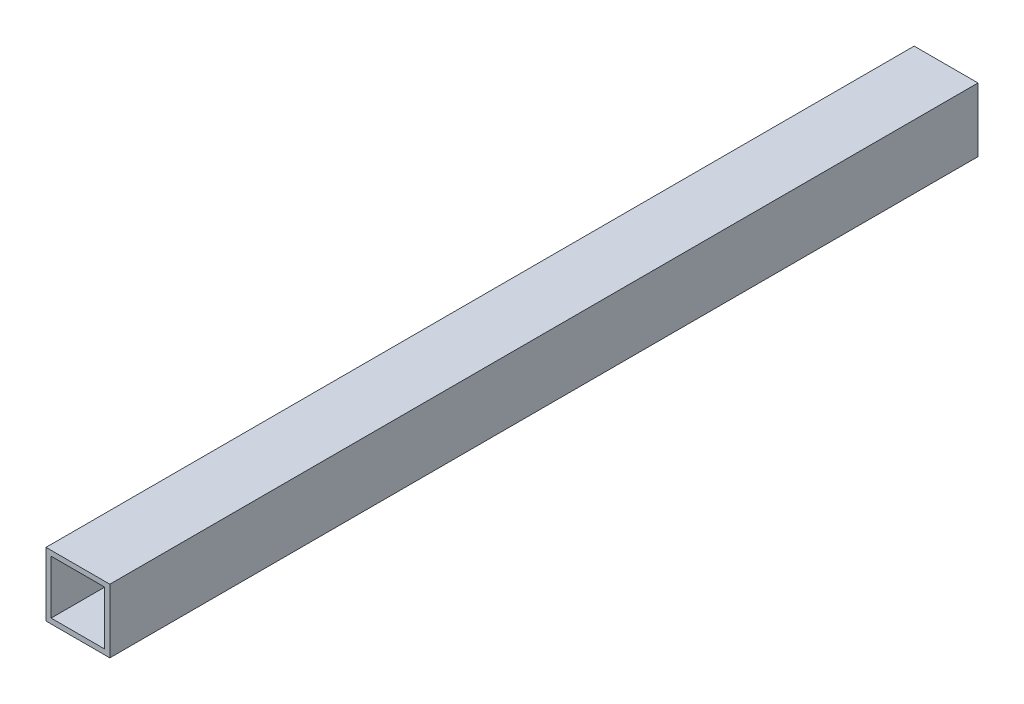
from build123d import *

# Parameters (mm, degrees)
ESQUISSE1_W             = 25
ESQUISSE1_H             = 25
BOSS_EXTRU_1_DEPTH      = 340
ESQUISSE2_W             = 21
ESQUISSE2_H             = 21
ENL_V_MAT_EXTRU_1_DEPTH = 342.833292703


with BuildPart() as part:
    # Esquisse1 → Boss.-Extru.1 (new body)
    with BuildSketch(Plane.XY):
        with Locations((12.5, 12.5)):
            Rectangle(ESQUISSE1_W, ESQUISSE1_H)
    extrude(amount=BOSS_EXTRU_1_DEPTH)

    # Esquisse2 → Enl_v. mat.-Extru.1 (cut, through all)
    with BuildSketch(Plane.XY.offset(340)):
        with Locations((12.5, 12.5)):
            Rectangle(ESQUISSE2_W, ESQUISSE2_H)
    extrude(amount=-ENL_V_MAT_EXTRU_1_DEPTH, mode=Mode.SUBTRACT)


solid = part.part
